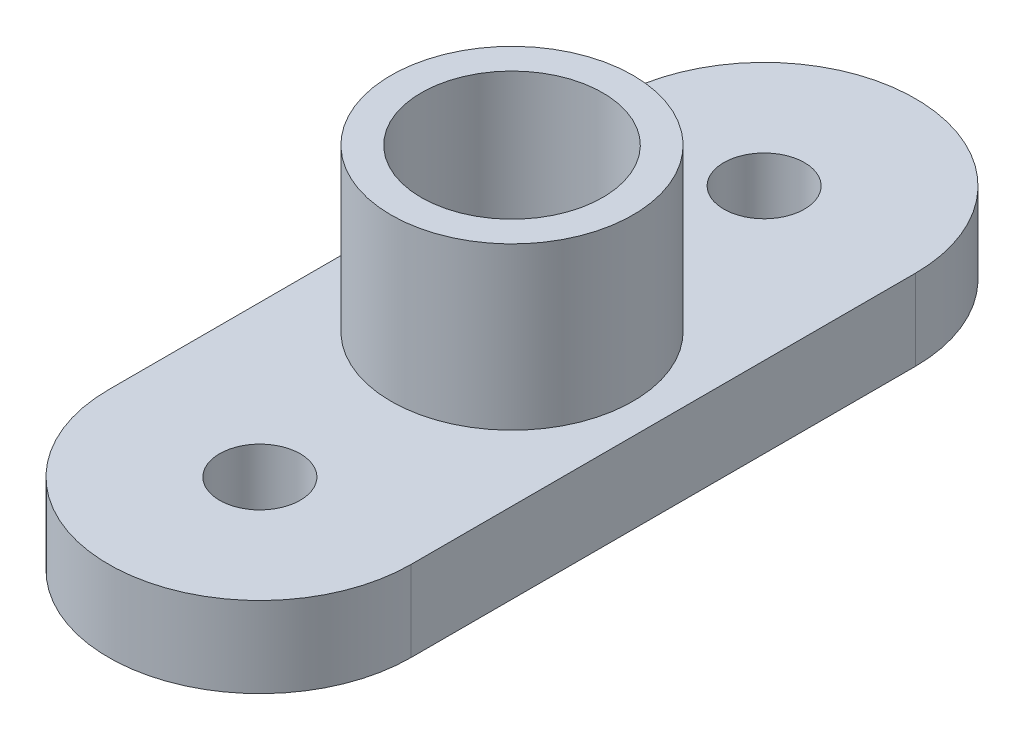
from build123d import *

# Parameters (mm, degrees)
SKETCH_1_R          = 12
EXTRUDE_1_DEPTH     = 16
SKETCH_2_R          = 4
EXTRUDE_2_DEPTH     = 8
SKETCH_3_R          = 9
CUT_EXTRUDE_1_DEPTH = 50


with BuildPart() as part:
    # Sketch 1 → Extrude 1 (new body)
    with BuildSketch(Plane(origin=(0, 0, 0), x_dir=(1, 0, 0), z_dir=(0, 1, 0))):
        with Locations(Location((0, 0, 0), (0, 0, 270))):
            Circle(SKETCH_1_R)
    extrude(amount=EXTRUDE_1_DEPTH)

    # Sketch 2 → Extrude 2 (add)
    with BuildSketch(Plane.XZ):
        with BuildLine():
            Line((15, 25), (15, -25))
            ThreePointArc((15, -25), (0, -40), (-15, -25))
            Line((-15, -25), (-15, 25))
            ThreePointArc((-15, 25), (0, 40), (15, 25))
        make_face()
        with Locations(Location((0, -25, 0), (0, 0, 270))):
            Circle(SKETCH_2_R, mode=Mode.SUBTRACT)
        with Locations(Location((0, 25, 0), (0, 0, 270))):
            Circle(SKETCH_2_R, mode=Mode.SUBTRACT)
    extrude(amount=EXTRUDE_2_DEPTH)

    # Sketch 3 → Cut-Extrude 1 (cut, through all)
    with BuildSketch(Plane(origin=(0, 16, 0), x_dir=(-1, 0, 0), z_dir=(0, 1, 0))):
        with Locations(Location((0, 0, 0), (0, 0, 90))):
            Circle(SKETCH_3_R)
    extrude(amount=-CUT_EXTRUDE_1_DEPTH, mode=Mode.SUBTRACT)


solid = part.part
